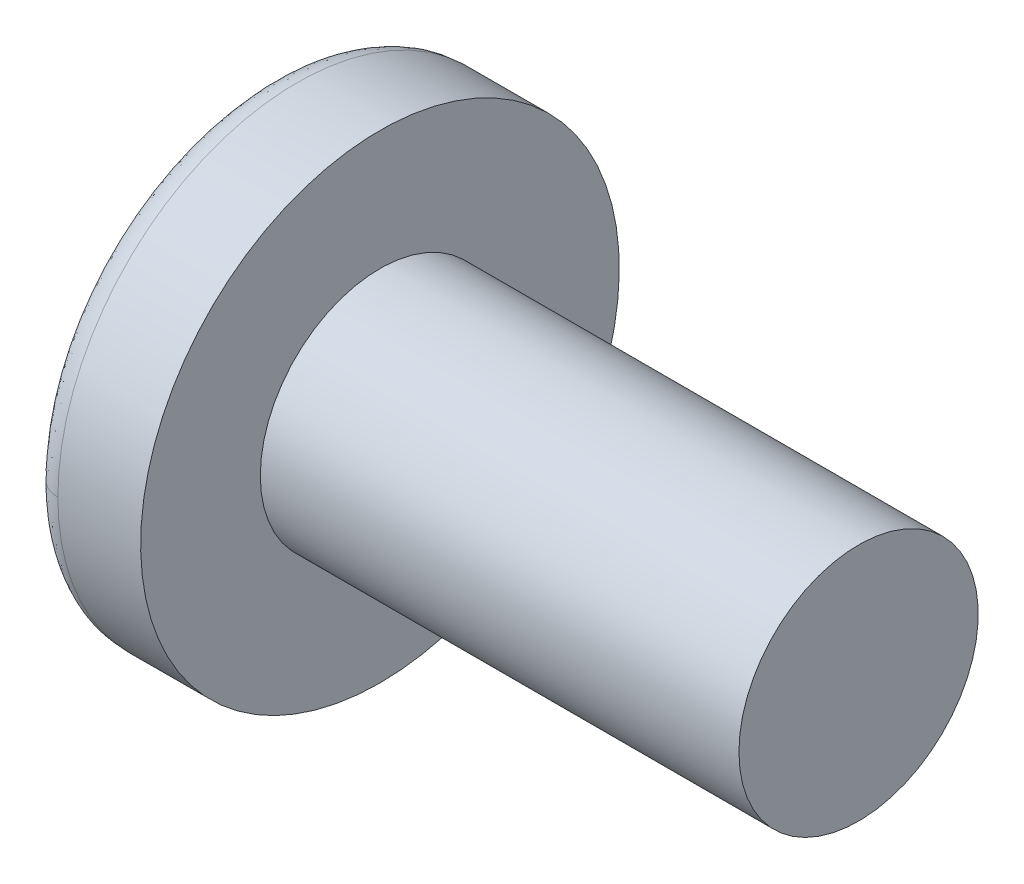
ISO-10303-21;
HEADER;
FILE_DESCRIPTION(('STEP AP214'),'2;1');
FILE_NAME('part.step','',(''),(''),'','','');
FILE_SCHEMA(('AUTOMOTIVE_DESIGN { 1 0 10303 214 1 1 1 1 }'));
ENDSEC;
DATA;
#1=APPLICATION_CONTEXT('core data for automotive mechanical design processes');
#2=APPLICATION_PROTOCOL_DEFINITION('international standard','automotive_design',2000,#1);
#3=PRODUCT_CONTEXT('',#1,'mechanical');
#4=PRODUCT('Part','Part','',(#3));
#5=PRODUCT_RELATED_PRODUCT_CATEGORY('part','',(#4));
#6=PRODUCT_DEFINITION_FORMATION('','',#4);
#7=PRODUCT_DEFINITION_CONTEXT('part definition',#1,'design');
#8=PRODUCT_DEFINITION('design','',#6,#7);
#9=PRODUCT_DEFINITION_SHAPE('','',#8);
#10=(LENGTH_UNIT() NAMED_UNIT(*) SI_UNIT(.MILLI.,.METRE.));
#11=(NAMED_UNIT(*) PLANE_ANGLE_UNIT() SI_UNIT($,.RADIAN.));
#12=(NAMED_UNIT(*) SI_UNIT($,.STERADIAN.) SOLID_ANGLE_UNIT());
#13=UNCERTAINTY_MEASURE_WITH_UNIT(LENGTH_MEASURE(1.E-05),#10,'distance_accuracy_value','');
#14=(GEOMETRIC_REPRESENTATION_CONTEXT(3) GLOBAL_UNCERTAINTY_ASSIGNED_CONTEXT((#13)) GLOBAL_UNIT_ASSIGNED_CONTEXT((#10,
#11,#12)) REPRESENTATION_CONTEXT('',''));
#15=CARTESIAN_POINT('',(0.,0.,0.));
#16=DIRECTION('',(0.,0.,1.));
#17=DIRECTION('',(1.,0.,0.));
#18=AXIS2_PLACEMENT_3D('',#15,#16,#17);
#19=CARTESIAN_POINT('',(22.,-4.048,4.048));
#20=DIRECTION('',(1.,0.,0.));
#21=DIRECTION('',(0.,0.,-1.));
#22=AXIS2_PLACEMENT_3D('',#19,#20,#21);
#23=PLANE('',#22);
#24=CARTESIAN_POINT('',(22.,0.,0.));
#25=DIRECTION('',(-1.,0.,0.));
#26=DIRECTION('',(0.,0.,1.));
#27=AXIS2_PLACEMENT_3D('',#24,#25,#26);
#28=CIRCLE('',#27,4.);
#29=CARTESIAN_POINT('',(22.,0.,4.));
#30=VERTEX_POINT('',#29);
#31=EDGE_CURVE('E21',#30,#30,#28,.T.);
#32=ORIENTED_EDGE('',*,*,#31,.F.);
#33=EDGE_LOOP('',(#32));
#34=FACE_BOUND('',#33,.T.);
#35=ADVANCED_FACE('F17',(#34),#23,.T.);
#36=CARTESIAN_POINT('',(4.88,-0.4225,-0.4225));
#37=DIRECTION('',(-1.,0.,0.));
#38=DIRECTION('',(0.,0.,1.));
#39=AXIS2_PLACEMENT_3D('',#36,#37,#38);
#40=PLANE('',#39);
#41=DIRECTION('',(0.,1.,0.));
#42=VECTOR('',#41,1.);
#43=CARTESIAN_POINT('',(4.88,0.,0.4225));
#44=LINE('',#43,#42);
#45=CARTESIAN_POINT('',(4.87999999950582,-0.422500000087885,0.42250000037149));
#46=VERTEX_POINT('',#45);
#47=CARTESIAN_POINT('',(4.87999999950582,0.422500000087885,0.42250000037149));
#48=VERTEX_POINT('',#47);
#49=EDGE_CURVE('E237',#46,#48,#44,.T.);
#50=ORIENTED_EDGE('',*,*,#49,.T.);
#51=DIRECTION('',(0.,0.,-1.));
#52=VECTOR('',#51,1.);
#53=CARTESIAN_POINT('',(4.88,0.4225,0.));
#54=LINE('',#53,#52);
#55=CARTESIAN_POINT('',(4.87999999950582,0.422500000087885,-0.42250000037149));
#56=VERTEX_POINT('',#55);
#57=EDGE_CURVE('E238',#48,#56,#54,.T.);
#58=ORIENTED_EDGE('',*,*,#57,.T.);
#59=DIRECTION('',(0.,-1.,0.));
#60=VECTOR('',#59,1.);
#61=CARTESIAN_POINT('',(4.88,0.,-0.4225));
#62=LINE('',#61,#60);
#63=CARTESIAN_POINT('',(4.87999999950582,-0.422500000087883,-0.422500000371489));
#64=VERTEX_POINT('',#63);
#65=EDGE_CURVE('E116',#56,#64,#62,.T.);
#66=ORIENTED_EDGE('',*,*,#65,.T.);
#67=DIRECTION('',(0.,0.,1.));
#68=VECTOR('',#67,1.);
#69=CARTESIAN_POINT('',(4.88,-0.4225,0.));
#70=LINE('',#69,#68);
#71=EDGE_CURVE('E264',#64,#46,#70,.T.);
#72=ORIENTED_EDGE('',*,*,#71,.T.);
#73=EDGE_LOOP('',(#50,#58,#66,#72));
#74=FACE_BOUND('',#73,.T.);
#75=ADVANCED_FACE('F368',(#74),#40,.T.);
#76=CARTESIAN_POINT('',(22.,0.,0.));
#77=DIRECTION('',(-1.,0.,0.));
#78=DIRECTION('',(0.,0.,1.));
#79=AXIS2_PLACEMENT_3D('',#76,#77,#78);
#80=CYLINDRICAL_SURFACE('',#79,4.);
#81=CARTESIAN_POINT('',(6.,0.,0.));
#82=DIRECTION('',(-1.,0.,0.));
#83=DIRECTION('',(0.,0.,1.));
#84=AXIS2_PLACEMENT_3D('',#81,#82,#83);
#85=CIRCLE('',#84,4.);
#86=CARTESIAN_POINT('',(6.,0.,4.));
#87=VERTEX_POINT('',#86);
#88=EDGE_CURVE('E265',#87,#87,#85,.F.);
#89=ORIENTED_EDGE('',*,*,#88,.T.);
#90=EDGE_LOOP('',(#89));
#91=FACE_BOUND('',#90,.T.);
#92=ORIENTED_EDGE('',*,*,#31,.T.);
#93=EDGE_LOOP('',(#92));
#94=FACE_BOUND('',#93,.T.);
#95=ADVANCED_FACE('F365',(#91,#94),#80,.T.);
#96=CARTESIAN_POINT('',(0.60051981,0.798550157,-4.007003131));
#97=DIRECTION('',(0.642113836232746,0.,-0.766609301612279));
#98=DIRECTION('',(0.766609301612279,0.,0.642113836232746));
#99=AXIS2_PLACEMENT_3D('',#96,#97,#98);
#100=PLANE('',#99);
#101=ORIENTED_EDGE('',*,*,#65,.F.);
#102=DIRECTION('',(0.764926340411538,-0.0662256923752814,0.640704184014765));
#103=VECTOR('',#102,1.);
#104=CARTESIAN_POINT('',(0.645878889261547,0.789081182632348,-3.96901025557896));
#105=LINE('',#104,#103);
#106=CARTESIAN_POINT('',(0.645878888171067,0.789081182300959,-3.9690102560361));
#107=VERTEX_POINT('',#106);
#108=EDGE_CURVE('E119',#107,#56,#105,.T.);
#109=ORIENTED_EDGE('',*,*,#108,.F.);
#110=CARTESIAN_POINT('',(0.645878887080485,-0.789081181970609,-3.96901025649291));
#111=CARTESIAN_POINT('',(0.632655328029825,-0.526054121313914,-3.9800863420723));
#112=CARTESIAN_POINT('',(0.626043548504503,-0.263027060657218,-3.98562438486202));
#113=CARTESIAN_POINT('',(0.626043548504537,0.263027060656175,-3.98562438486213));
#114=CARTESIAN_POINT('',(0.632655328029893,0.526054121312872,-3.98008634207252));
#115=CARTESIAN_POINT('',(0.645878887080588,0.78908118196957,-3.96901025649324));
#116=B_SPLINE_CURVE_WITH_KNOTS('',3,(#110,#111,#112,#113,#114,#115),.UNSPECIFIED.,.F.,.F.,(4,2,
4),(0.,0.78950527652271,1.57901055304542),.UNSPECIFIED.);
#117=CARTESIAN_POINT('',(0.645878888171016,-0.789081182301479,-3.96901025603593));
#118=VERTEX_POINT('',#117);
#119=EDGE_CURVE('E104',#118,#107,#116,.T.);
#120=ORIENTED_EDGE('',*,*,#119,.F.);
#121=DIRECTION('',(-0.764926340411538,-0.0662256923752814,-0.640704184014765));
#122=VECTOR('',#121,1.);
#123=CARTESIAN_POINT('',(4.87999999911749,-0.422500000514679,-0.422500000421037));
#124=LINE('',#123,#122);
#125=EDGE_CURVE('E124',#64,#118,#124,.T.);
#126=ORIENTED_EDGE('',*,*,#125,.F.);
#127=EDGE_LOOP('',(#101,#109,#120,#126));
#128=FACE_BOUND('',#127,.T.);
#129=ADVANCED_FACE('F120',(#128),#100,.F.);
#130=CARTESIAN_POINT('',(4.88,0.4225,-0.798550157));
#131=DIRECTION('',(0.642113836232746,0.766609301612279,0.));
#132=DIRECTION('',(-0.766609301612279,0.642113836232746,0.));
#133=AXIS2_PLACEMENT_3D('',#130,#131,#132);
#134=PLANE('',#133);
#135=ORIENTED_EDGE('',*,*,#57,.F.);
#136=DIRECTION('',(0.764926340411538,-0.640704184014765,-0.0662256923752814));
#137=VECTOR('',#136,1.);
#138=CARTESIAN_POINT('',(0.645878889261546,3.96901025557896,0.789081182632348));
#139=LINE('',#138,#137);
#140=CARTESIAN_POINT('',(0.645878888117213,3.969010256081,0.789081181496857));
#141=VERTEX_POINT('',#140);
#142=EDGE_CURVE('E280',#141,#48,#139,.T.);
#143=ORIENTED_EDGE('',*,*,#142,.F.);
#144=CARTESIAN_POINT('',(0.626043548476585,3.98562438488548,9.22820369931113E-10));
#145=CARTESIAN_POINT('',(0.626044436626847,3.98562364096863,0.131654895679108));
#146=CARTESIAN_POINT('',(0.627697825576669,3.98423875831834,0.263239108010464));
#147=CARTESIAN_POINT('',(0.634309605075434,3.97870071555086,0.526266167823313));
#148=CARTESIAN_POINT('',(0.639267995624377,3.97454755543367,0.657709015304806));
#149=CARTESIAN_POINT('',(0.64587888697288,3.96901025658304,0.789081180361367));
#150=B_SPLINE_CURVE_WITH_KNOTS('',3,(#144,#145,#146,#147,#148,#149),.UNSPECIFIED.,.F.,.F.,(4,2,
4),(0.,0.394805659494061,0.789611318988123),.UNSPECIFIED.);
#151=CARTESIAN_POINT('',(0.626043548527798,3.98562438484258,2.77471515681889E-09));
#152=VERTEX_POINT('',#151);
#153=EDGE_CURVE('E239',#152,#141,#150,.T.);
#154=ORIENTED_EDGE('',*,*,#153,.F.);
#155=CARTESIAN_POINT('',(0.645878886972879,3.96901025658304,-0.789081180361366));
#156=CARTESIAN_POINT('',(0.63926799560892,3.97454755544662,-0.657709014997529));
#157=CARTESIAN_POINT('',(0.634309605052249,3.97870071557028,-0.526266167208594));
#158=CARTESIAN_POINT('',(0.627697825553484,3.98423875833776,-0.263239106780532));
#159=CARTESIAN_POINT('',(0.62604443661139,3.98562364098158,-0.131654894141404));
#160=CARTESIAN_POINT('',(0.626043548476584,3.98562438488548,9.22820778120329E-10));
#161=B_SPLINE_CURVE_WITH_KNOTS('',3,(#155,#156,#157,#158,#159,#160),.UNSPECIFIED.,.F.,.F.,(4,2,
4),(0.,0.394805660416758,0.789611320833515),.UNSPECIFIED.);
#162=CARTESIAN_POINT('',(0.645878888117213,3.969010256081,-0.789081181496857));
#163=VERTEX_POINT('',#162);
#164=EDGE_CURVE('E353',#163,#152,#161,.T.);
#165=ORIENTED_EDGE('',*,*,#164,.F.);
#166=DIRECTION('',(-0.764926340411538,0.640704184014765,-0.0662256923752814));
#167=VECTOR('',#166,1.);
#168=CARTESIAN_POINT('',(4.87999999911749,0.422500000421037,-0.422500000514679));
#169=LINE('',#168,#167);
#170=EDGE_CURVE('E276',#56,#163,#169,.T.);
#171=ORIENTED_EDGE('',*,*,#170,.F.);
#172=EDGE_LOOP('',(#135,#143,#154,#165,#171));
#173=FACE_BOUND('',#172,.T.);
#174=ADVANCED_FACE('F249',(#173),#134,.F.);
#175=CARTESIAN_POINT('',(4.88,0.798550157,0.4225));
#176=DIRECTION('',(0.642113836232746,0.,0.766609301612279));
#177=DIRECTION('',(-0.766609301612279,0.,0.642113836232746));
#178=AXIS2_PLACEMENT_3D('',#175,#176,#177);
#179=PLANE('',#178);
#180=ORIENTED_EDGE('',*,*,#49,.F.);
#181=DIRECTION('',(0.764926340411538,0.0662256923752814,-0.640704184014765));
#182=VECTOR('',#181,1.);
#183=CARTESIAN_POINT('',(0.645878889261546,-0.789081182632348,3.96901025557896));
#184=LINE('',#183,#182);
#185=CARTESIAN_POINT('',(0.645878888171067,-0.789081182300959,3.9690102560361));
#186=VERTEX_POINT('',#185);
#187=EDGE_CURVE('E289',#186,#46,#184,.T.);
#188=ORIENTED_EDGE('',*,*,#187,.F.);
#189=CARTESIAN_POINT('',(0.645878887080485,0.789081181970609,3.9690102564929));
#190=CARTESIAN_POINT('',(0.632655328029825,0.526054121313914,3.9800863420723));
#191=CARTESIAN_POINT('',(0.626043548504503,0.263027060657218,3.98562438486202));
#192=CARTESIAN_POINT('',(0.626043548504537,-0.263027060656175,3.98562438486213));
#193=CARTESIAN_POINT('',(0.632655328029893,-0.526054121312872,3.98008634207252));
#194=CARTESIAN_POINT('',(0.645878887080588,-0.78908118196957,3.96901025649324));
#195=B_SPLINE_CURVE_WITH_KNOTS('',3,(#189,#190,#191,#192,#193,#194),.UNSPECIFIED.,.F.,.F.,(4,2,
4),(0.,0.78950527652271,1.57901055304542),.UNSPECIFIED.);
#196=CARTESIAN_POINT('',(0.645878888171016,0.789081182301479,3.96901025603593));
#197=VERTEX_POINT('',#196);
#198=EDGE_CURVE('E232',#197,#186,#195,.T.);
#199=ORIENTED_EDGE('',*,*,#198,.F.);
#200=DIRECTION('',(-0.764926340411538,0.0662256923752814,0.640704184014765));
#201=VECTOR('',#200,1.);
#202=CARTESIAN_POINT('',(4.87999999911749,0.422500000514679,0.422500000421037));
#203=LINE('',#202,#201);
#204=EDGE_CURVE('E286',#48,#197,#203,.T.);
#205=ORIENTED_EDGE('',*,*,#204,.F.);
#206=EDGE_LOOP('',(#180,#188,#199,#205));
#207=FACE_BOUND('',#206,.T.);
#208=ADVANCED_FACE('F245',(#207),#179,.F.);
#209=CARTESIAN_POINT('',(0.60051981,-4.007003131,-0.798550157));
#210=DIRECTION('',(0.642113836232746,-0.766609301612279,0.));
#211=DIRECTION('',(0.766609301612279,0.642113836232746,0.));
#212=AXIS2_PLACEMENT_3D('',#209,#210,#211);
#213=PLANE('',#212);
#214=ORIENTED_EDGE('',*,*,#71,.F.);
#215=DIRECTION('',(0.764926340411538,0.640704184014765,0.0662256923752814));
#216=VECTOR('',#215,1.);
#217=CARTESIAN_POINT('',(0.645878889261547,-3.96901025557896,-0.789081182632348));
#218=LINE('',#217,#216);
#219=CARTESIAN_POINT('',(0.645878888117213,-3.969010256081,-0.789081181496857));
#220=VERTEX_POINT('',#219);
#221=EDGE_CURVE('E268',#220,#64,#218,.T.);
#222=ORIENTED_EDGE('',*,*,#221,.F.);
#223=CARTESIAN_POINT('',(0.626043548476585,-3.98562438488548,9.22821577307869E-10));
#224=CARTESIAN_POINT('',(0.62604443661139,-3.98562364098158,-0.131654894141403));
#225=CARTESIAN_POINT('',(0.627697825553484,-3.98423875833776,-0.263239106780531));
#226=CARTESIAN_POINT('',(0.634309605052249,-3.97870071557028,-0.526266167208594));
#227=CARTESIAN_POINT('',(0.63926799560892,-3.97454755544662,-0.657709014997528));
#228=CARTESIAN_POINT('',(0.64587888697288,-3.96901025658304,-0.789081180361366));
#229=B_SPLINE_CURVE_WITH_KNOTS('',3,(#223,#224,#225,#226,#227,#228),.UNSPECIFIED.,.F.,.F.,(4,2,
4),(0.,0.394805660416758,0.789611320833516),.UNSPECIFIED.);
#230=CARTESIAN_POINT('',(0.626043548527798,-3.98562438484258,2.77471621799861E-09));
#231=VERTEX_POINT('',#230);
#232=EDGE_CURVE('E259',#231,#220,#229,.T.);
#233=ORIENTED_EDGE('',*,*,#232,.F.);
#234=CARTESIAN_POINT('',(0.645878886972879,-3.96901025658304,0.789081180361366));
#235=CARTESIAN_POINT('',(0.639267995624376,-3.97454755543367,0.657709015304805));
#236=CARTESIAN_POINT('',(0.634309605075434,-3.97870071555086,0.526266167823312));
#237=CARTESIAN_POINT('',(0.627697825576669,-3.98423875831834,0.263239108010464));
#238=CARTESIAN_POINT('',(0.626044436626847,-3.98562364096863,0.131654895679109));
#239=CARTESIAN_POINT('',(0.626043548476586,-3.98562438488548,9.22821274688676E-10));
#240=B_SPLINE_CURVE_WITH_KNOTS('',3,(#234,#235,#236,#237,#238,#239),.UNSPECIFIED.,.F.,.F.,(4,2,
4),(0.,0.39480565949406,0.789611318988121),.UNSPECIFIED.);
#241=CARTESIAN_POINT('',(0.645878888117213,-3.969010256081,0.789081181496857));
#242=VERTEX_POINT('',#241);
#243=EDGE_CURVE('E225',#242,#231,#240,.T.);
#244=ORIENTED_EDGE('',*,*,#243,.F.);
#245=DIRECTION('',(-0.764926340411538,-0.640704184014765,0.0662256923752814));
#246=VECTOR('',#245,1.);
#247=CARTESIAN_POINT('',(4.87999999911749,-0.422500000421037,0.422500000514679));
#248=LINE('',#247,#246);
#249=EDGE_CURVE('E295',#46,#242,#248,.T.);
#250=ORIENTED_EDGE('',*,*,#249,.F.);
#251=EDGE_LOOP('',(#214,#222,#233,#244,#250));
#252=FACE_BOUND('',#251,.T.);
#253=ADVANCED_FACE('F248',(#252),#213,.F.);
#254=CARTESIAN_POINT('',(6.,-8.096,-8.096));
#255=DIRECTION('',(-1.,0.,0.));
#256=DIRECTION('',(0.,0.,1.));
#257=AXIS2_PLACEMENT_3D('',#254,#255,#256);
#258=PLANE('',#257);
#259=ORIENTED_EDGE('',*,*,#88,.F.);
#260=EDGE_LOOP('',(#259));
#261=FACE_BOUND('',#260,.T.);
#262=CARTESIAN_POINT('',(6.,0.,0.));
#263=DIRECTION('',(-1.,0.,0.));
#264=DIRECTION('',(0.,-1.,0.));
#265=AXIS2_PLACEMENT_3D('',#262,#263,#264);
#266=CIRCLE('',#265,8.);
#267=CARTESIAN_POINT('',(6.,-8.,0.));
#268=VERTEX_POINT('',#267);
#269=EDGE_CURVE('E298',#268,#268,#266,.T.);
#270=ORIENTED_EDGE('',*,*,#269,.F.);
#271=EDGE_LOOP('',(#270));
#272=FACE_BOUND('',#271,.T.);
#273=ADVANCED_FACE('F256',(#261,#272),#258,.F.);
#274=CARTESIAN_POINT('',(0.025474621,-3.990289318,-0.842794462));
#275=DIRECTION('',(-0.0862551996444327,0.,0.996273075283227));
#276=DIRECTION('',(0.996273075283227,0.,0.0862551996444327));
#277=AXIS2_PLACEMENT_3D('',#274,#275,#276);
#278=PLANE('',#277);
#279=DIRECTION('',(0.992587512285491,0.0859361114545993,0.0859361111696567));
#280=VECTOR('',#279,1.);
#281=CARTESIAN_POINT('',(0.0544280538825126,-0.840287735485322,-0.8402877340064));
#282=LINE('',#281,#280);
#283=CARTESIAN_POINT('',(0.0544280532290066,-0.840287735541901,-0.840287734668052));
#284=VERTEX_POINT('',#283);
#285=EDGE_CURVE('E271',#284,#64,#282,.T.);
#286=ORIENTED_EDGE('',*,*,#285,.F.);
#287=CARTESIAN_POINT('',(0.645878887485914,-3.96901025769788,-0.789081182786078));
#288=CARTESIAN_POINT('',(0.613384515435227,-3.86730842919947,-0.791894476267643));
#289=CARTESIAN_POINT('',(0.582139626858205,-3.76520441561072,-0.794599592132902));
#290=CARTESIAN_POINT('',(0.522238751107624,-3.56050099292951,-0.799785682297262));
#291=CARTESIAN_POINT('',(0.493576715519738,-3.45790336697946,-0.802267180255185));
#292=CARTESIAN_POINT('',(0.438824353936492,-3.25221726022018,-0.807007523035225));
#293=CARTESIAN_POINT('',(0.412729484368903,-3.14912999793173,-0.809266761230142));
#294=CARTESIAN_POINT('',(0.363098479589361,-2.94246801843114,-0.813563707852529));
#295=CARTESIAN_POINT('',(0.339559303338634,-2.83889403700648,-0.815601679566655));
#296=CARTESIAN_POINT('',(0.295031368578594,-2.63126074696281,-0.819456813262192));
#297=CARTESIAN_POINT('',(0.274041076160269,-2.52720176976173,-0.821274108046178));
#298=CARTESIAN_POINT('',(0.234606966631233,-2.31859882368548,-0.824688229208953));
#299=CARTESIAN_POINT('',(0.216163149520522,-2.2140548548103,-0.826285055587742));
#300=CARTESIAN_POINT('',(0.181822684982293,-2.00448129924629,-0.829258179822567));
#301=CARTESIAN_POINT('',(0.165927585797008,-1.89945145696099,-0.830634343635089));
#302=CARTESIAN_POINT('',(0.136689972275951,-1.68890543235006,-0.833165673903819));
#303=CARTESIAN_POINT('',(0.123350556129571,-1.58338881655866,-0.834320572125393));
#304=CARTESIAN_POINT('',(0.0992344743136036,-1.37186784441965,-0.836408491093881));
#305=CARTESIAN_POINT('',(0.0884624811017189,-1.265862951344,-0.837341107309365));
#306=CARTESIAN_POINT('',(0.0694956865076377,-1.05336338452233,-0.838983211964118));
#307=CARTESIAN_POINT('',(0.0613071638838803,-0.946868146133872,-0.839692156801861));
#308=CARTESIAN_POINT('',(0.0544280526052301,-0.840287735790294,-0.840287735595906));
#309=B_SPLINE_CURVE_WITH_KNOTS('',3,(#287,#288,#289,#290,#291,#292,#293,#294,#295,#296,#297,
#298,#299,#300,#301,#302,#303,#304,#305,#306,#307,#308),.UNSPECIFIED.,.F.,.F.,(4,2,2,2,2,2,2,2,
2,2,4),(0.,0.320403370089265,0.640035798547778,0.959091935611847,1.27776416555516,
1.59624365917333,1.91472315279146,2.23339538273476,2.55245151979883,2.87208394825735,
3.1924873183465),.UNSPECIFIED.);
#310=EDGE_CURVE('E133',#220,#284,#309,.T.);
#311=ORIENTED_EDGE('',*,*,#310,.F.);
#312=ORIENTED_EDGE('',*,*,#221,.T.);
#313=EDGE_LOOP('',(#286,#311,#312));
#314=FACE_BOUND('',#313,.T.);
#315=ADVANCED_FACE('F304',(#314),#278,.T.);
#316=CARTESIAN_POINT('',(4.908953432,-0.419993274,-3.990289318));
#317=DIRECTION('',(-0.0862551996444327,0.996273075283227,0.));
#318=DIRECTION('',(-0.996273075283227,-0.0862551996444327,0.));
#319=AXIS2_PLACEMENT_3D('',#316,#317,#318);
#320=PLANE('',#319);
#321=ORIENTED_EDGE('',*,*,#285,.T.);
#322=ORIENTED_EDGE('',*,*,#125,.T.);
#323=CARTESIAN_POINT('',(0.0544280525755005,-0.840287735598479,-0.840287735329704));
#324=CARTESIAN_POINT('',(0.061307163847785,-0.839692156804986,-0.946868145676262));
#325=CARTESIAN_POINT('',(0.0694956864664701,-0.838983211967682,-1.05336338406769));
#326=CARTESIAN_POINT('',(0.0884624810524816,-0.837341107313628,-1.26586295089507));
#327=CARTESIAN_POINT('',(0.0992344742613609,-0.836408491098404,-1.37186784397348));
#328=CARTESIAN_POINT('',(0.123350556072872,-0.834320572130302,-1.58338881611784));
#329=CARTESIAN_POINT('',(0.136689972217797,-0.833165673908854,-1.68890543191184));
#330=CARTESIAN_POINT('',(0.16592758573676,-0.830634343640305,-1.89945145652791));
#331=CARTESIAN_POINT('',(0.181822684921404,-0.829258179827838,-2.00448129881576));
#332=CARTESIAN_POINT('',(0.21616314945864,-0.8262850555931,-2.21405485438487));
#333=CARTESIAN_POINT('',(0.234606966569,-0.824688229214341,-2.3185988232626));
#334=CARTESIAN_POINT('',(0.274041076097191,-0.821274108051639,-2.52720176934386));
#335=CARTESIAN_POINT('',(0.295031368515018,-0.819456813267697,-2.63126074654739));
#336=CARTESIAN_POINT('',(0.33955930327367,-0.815601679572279,-2.83889403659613));
#337=CARTESIAN_POINT('',(0.363098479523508,-0.813563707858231,-2.94246801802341));
#338=CARTESIAN_POINT('',(0.412729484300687,-0.809266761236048,-3.14912999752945));
#339=CARTESIAN_POINT('',(0.438824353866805,-0.807007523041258,-3.25221725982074));
#340=CARTESIAN_POINT('',(0.493576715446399,-0.802267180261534,-3.45790336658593));
#341=CARTESIAN_POINT('',(0.522238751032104,-0.7997856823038,-3.56050099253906));
#342=CARTESIAN_POINT('',(0.582139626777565,-0.794599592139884,-3.76520441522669));
#343=CARTESIAN_POINT('',(0.613384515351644,-0.791894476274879,-3.86730842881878));
#344=CARTESIAN_POINT('',(0.645878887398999,-0.789081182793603,-3.96901025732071));
#345=B_SPLINE_CURVE_WITH_KNOTS('',3,(#323,#324,#325,#326,#327,#328,#329,#330,#331,#332,#333,
#334,#335,#336,#337,#338,#339,#340,#341,#342,#343,#344),.UNSPECIFIED.,.F.,.F.,(4,2,2,2,2,2,2,2,
2,2,4),(0.,0.320403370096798,0.640035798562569,0.9590919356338,1.27776416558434,
1.59624365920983,1.91472315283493,2.23339538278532,2.55245151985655,2.87208394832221,
3.19248731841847),.UNSPECIFIED.);
#346=EDGE_CURVE('E115',#284,#118,#345,.T.);
#347=ORIENTED_EDGE('',*,*,#346,.F.);
#348=EDGE_LOOP('',(#321,#322,#347));
#349=FACE_BOUND('',#348,.T.);
#350=ADVANCED_FACE('F158',(#349),#320,.T.);
#351=CARTESIAN_POINT('',(0.025474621,0.842794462,-3.990289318));
#352=DIRECTION('',(-0.0862551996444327,-0.996273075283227,0.));
#353=DIRECTION('',(0.996273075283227,-0.0862551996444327,0.));
#354=AXIS2_PLACEMENT_3D('',#351,#352,#353);
#355=PLANE('',#354);
#356=ORIENTED_EDGE('',*,*,#108,.T.);
#357=DIRECTION('',(0.992587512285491,-0.0859361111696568,0.0859361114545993));
#358=VECTOR('',#357,1.);
#359=CARTESIAN_POINT('',(0.0544280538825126,0.8402877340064,-0.840287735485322));
#360=LINE('',#359,#358);
#361=CARTESIAN_POINT('',(0.0544280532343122,0.84028773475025,-0.840287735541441));
#362=VERTEX_POINT('',#361);
#363=EDGE_CURVE('E123',#362,#56,#360,.T.);
#364=ORIENTED_EDGE('',*,*,#363,.F.);
#365=CARTESIAN_POINT('',(0.645878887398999,0.789081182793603,-3.96901025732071));
#366=CARTESIAN_POINT('',(0.613384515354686,0.791894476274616,-3.86730842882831));
#367=CARTESIAN_POINT('',(0.582139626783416,0.794599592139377,-3.76520441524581));
#368=CARTESIAN_POINT('',(0.52223875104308,0.79978568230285,-3.56050099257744));
#369=CARTESIAN_POINT('',(0.493576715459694,0.802267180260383,-3.45790336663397));
#370=CARTESIAN_POINT('',(0.43882435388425,0.807007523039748,-3.25221725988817));
#371=CARTESIAN_POINT('',(0.412729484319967,0.809266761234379,-3.14912999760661));
#372=CARTESIAN_POINT('',(0.363098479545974,0.813563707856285,-2.94246801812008));
#373=CARTESIAN_POINT('',(0.33955930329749,0.815601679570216,-2.83889403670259));
#374=CARTESIAN_POINT('',(0.295031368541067,0.819456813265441,-2.63126074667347));
#375=CARTESIAN_POINT('',(0.274041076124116,0.821274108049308,-2.52720176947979));
#376=CARTESIAN_POINT('',(0.234606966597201,0.8246882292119,-2.31859882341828));
#377=CARTESIAN_POINT('',(0.21616314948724,0.826285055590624,-2.21405485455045));
#378=CARTESIAN_POINT('',(0.181822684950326,0.829258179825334,-2.00448129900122));
#379=CARTESIAN_POINT('',(0.165927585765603,0.830634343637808,-1.89945145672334));
#380=CARTESIAN_POINT('',(0.136689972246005,0.833165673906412,-1.68890543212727));
#381=CARTESIAN_POINT('',(0.123350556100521,0.834320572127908,-1.58338881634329));
#382=CARTESIAN_POINT('',(0.0992344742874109,0.836408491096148,-1.37186784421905));
#383=CARTESIAN_POINT('',(0.0884624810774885,0.837341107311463,-1.26586295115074));
#384=CARTESIAN_POINT('',(0.0694956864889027,0.83898321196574,-1.05336338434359));
#385=CARTESIAN_POINT('',(0.061307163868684,0.839692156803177,-0.946868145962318));
#386=CARTESIAN_POINT('',(0.0544280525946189,0.840287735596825,-0.840287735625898));
#387=B_SPLINE_CURVE_WITH_KNOTS('',3,(#365,#366,#367,#368,#369,#370,#371,#372,#373,#374,#375,
#376,#377,#378,#379,#380,#381,#382,#383,#384,#385,#386),.UNSPECIFIED.,.F.,.F.,(4,2,2,2,2,2,2,2,
2,2,4),(0.,0.320403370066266,0.640035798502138,0.959091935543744,1.27776416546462,
1.59624365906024,1.91472315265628,2.23339538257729,2.5524515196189,2.87208394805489,
3.19248731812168),.UNSPECIFIED.);
#388=EDGE_CURVE('E112',#107,#362,#387,.T.);
#389=ORIENTED_EDGE('',*,*,#388,.F.);
#390=EDGE_LOOP('',(#356,#364,#389));
#391=FACE_BOUND('',#390,.T.);
#392=ADVANCED_FACE('F126',(#391),#355,.T.);
#393=CARTESIAN_POINT('',(0.025474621,0.401220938,-0.842794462));
#394=DIRECTION('',(-0.0862551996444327,0.,0.996273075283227));
#395=DIRECTION('',(0.996273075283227,0.,0.0862551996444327));
#396=AXIS2_PLACEMENT_3D('',#393,#394,#395);
#397=PLANE('',#396);
#398=ORIENTED_EDGE('',*,*,#363,.T.);
#399=ORIENTED_EDGE('',*,*,#170,.T.);
#400=CARTESIAN_POINT('',(0.0544280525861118,0.840287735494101,-0.840287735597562));
#401=CARTESIAN_POINT('',(0.0613071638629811,0.946868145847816,-0.839692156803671));
#402=CARTESIAN_POINT('',(0.069495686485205,1.05336338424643,-0.83898321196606));
#403=CARTESIAN_POINT('',(0.088462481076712,1.26586295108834,-0.83734110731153));
#404=CARTESIAN_POINT('',(0.0992344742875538,1.37186784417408,-0.836408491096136));
#405=CARTESIAN_POINT('',(0.123350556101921,1.5833888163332,-0.834320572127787));
#406=CARTESIAN_POINT('',(0.136689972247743,1.68890543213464,-0.833165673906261));
#407=CARTESIAN_POINT('',(0.165927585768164,1.89945145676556,-0.830634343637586));
#408=CARTESIAN_POINT('',(0.181822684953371,2.00448129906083,-0.829258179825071));
#409=CARTESIAN_POINT('',(0.216163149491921,2.21405485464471,-0.826285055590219));
#410=CARTESIAN_POINT('',(0.234606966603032,2.3185988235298,-0.824688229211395));
#411=CARTESIAN_POINT('',(0.274041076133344,2.5272017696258,-0.821274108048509));
#412=CARTESIAN_POINT('',(0.295031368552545,2.63126074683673,-0.819456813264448));
#413=CARTESIAN_POINT('',(0.339559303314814,2.83889403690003,-0.815601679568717));
#414=CARTESIAN_POINT('',(0.363098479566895,2.94246801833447,-0.813563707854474));
#415=CARTESIAN_POINT('',(0.412729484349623,3.14912999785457,-0.809266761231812));
#416=CARTESIAN_POINT('',(0.438824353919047,3.25221726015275,-0.807007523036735));
#417=CARTESIAN_POINT('',(0.493576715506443,3.45790336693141,-0.802267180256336));
#418=CARTESIAN_POINT('',(0.522238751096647,3.56050099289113,-0.799785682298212));
#419=CARTESIAN_POINT('',(0.582139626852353,3.7652044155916,-0.794599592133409));
#420=CARTESIAN_POINT('',(0.613384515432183,3.86730842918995,-0.791894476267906));
#421=CARTESIAN_POINT('',(0.645878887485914,3.96901025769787,-0.789081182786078));
#422=B_SPLINE_CURVE_WITH_KNOTS('',3,(#400,#401,#402,#403,#404,#405,#406,#407,#408,#409,#410,
#411,#412,#413,#414,#415,#416,#417,#418,#419,#420,#421),.UNSPECIFIED.,.F.,.F.,(4,2,2,2,2,2,2,2,
2,2,4),(0.,0.320403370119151,0.640035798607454,0.95909193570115,1.27776416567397,
1.59624365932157,1.9147231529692,2.23339538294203,2.55245152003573,2.87208394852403,
3.19248731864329),.UNSPECIFIED.);
#423=EDGE_CURVE('E129',#362,#163,#422,.T.);
#424=ORIENTED_EDGE('',*,*,#423,.F.);
#425=EDGE_LOOP('',(#398,#399,#424));
#426=FACE_BOUND('',#425,.T.);
#427=ADVANCED_FACE('F157',(#426),#397,.T.);
#428=CARTESIAN_POINT('',(2.401771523,0.,-7.520775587));
#429=CARTESIAN_POINT('',(2.401771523,-15.041551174,-7.520775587));
#430=CARTESIAN_POINT('',(2.401771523,-15.041551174,7.520775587));
#431=CARTESIAN_POINT('',(2.401771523,0.,7.520775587));
#432=CARTESIAN_POINT('',(2.596300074,0.,-7.856984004));
#433=CARTESIAN_POINT('',(2.596300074,-15.713968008,-7.856984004));
#434=CARTESIAN_POINT('',(2.596300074,-15.713968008,7.856984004));
#435=CARTESIAN_POINT('',(2.596300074,0.,7.856984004));
#436=CARTESIAN_POINT('',(2.942058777,0.,-8.03398224));
#437=CARTESIAN_POINT('',(2.942058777,-16.06796448,-8.03398224));
#438=CARTESIAN_POINT('',(2.942058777,-16.06796448,8.03398224));
#439=CARTESIAN_POINT('',(2.942058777,0.,8.03398224));
#440=CARTESIAN_POINT('',(3.328547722,0.,-7.995203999));
#441=CARTESIAN_POINT('',(3.328547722,-15.990407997,-7.995203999));
#442=CARTESIAN_POINT('',(3.328547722,-15.990407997,7.995203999));
#443=CARTESIAN_POINT('',(3.328547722,0.,7.995203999));
#444=(BOUNDED_SURFACE() B_SPLINE_SURFACE(3,3,((#428,#429,#430,#431),(#432,#433,#434,#435),(#436,
#437,#438,#439),(#440,#441,#442,#443)),.UNSPECIFIED.,.F.,.F.,
.F.) B_SPLINE_SURFACE_WITH_KNOTS((4,4),(4,4),(0.,1.),(0.,1.),
.UNSPECIFIED.) GEOMETRIC_REPRESENTATION_ITEM() RATIONAL_B_SPLINE_SURFACE(((1.,0.333333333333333,
0.333333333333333,1.),(0.893471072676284,0.297823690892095,0.297823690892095,0.893471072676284),
(0.893471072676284,0.297823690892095,0.297823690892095,0.893471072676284),(1.,0.333333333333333,
0.333333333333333,1.))) REPRESENTATION_ITEM('') SURFACE());
#445=CARTESIAN_POINT('',(2.453920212,-7.563353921,-0.758866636));
#446=CARTESIAN_POINT('',(2.453920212,-8.043972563,4.03128847));
#447=CARTESIAN_POINT('',(2.453920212,-4.814206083,7.601328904));
#448=CARTESIAN_POINT('',(2.453920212,0.,7.601328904));
#449=CARTESIAN_POINT('',(2.453920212,4.814206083,7.601328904));
#450=CARTESIAN_POINT('',(2.453920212,8.043972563,4.03128847));
#451=CARTESIAN_POINT('',(2.453920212,7.563353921,-0.758866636));
#452=(BOUNDED_CURVE() B_SPLINE_CURVE(3,(#445,#446,#447,#448,#449,#450,#451),.UNSPECIFIED.,.F.,
.F.) B_SPLINE_CURVE_WITH_KNOTS((4,3,4),(0.,0.5,1.),
.UNSPECIFIED.) CURVE() GEOMETRIC_REPRESENTATION_ITEM() RATIONAL_B_SPLINE_CURVE((1.,
0.780588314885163,0.780588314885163,1.,0.780588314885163,0.780588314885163,1.)) REPRESENTATION_ITEM(''));
#453=CARTESIAN_POINT('',(2.45392021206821,-7.60132890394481,1.66384160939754E-09));
#454=VERTEX_POINT('',#453);
#455=CARTESIAN_POINT('',(2.45392021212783,-1.22347464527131E-13,7.60132890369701));
#456=VERTEX_POINT('',#455);
#457=EDGE_CURVE('E328',#454,#456,#452,.T.);
#458=CARTESIAN_POINT('',(2.453920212,7.563353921,0.758866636));
#459=CARTESIAN_POINT('',(2.453920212,8.043972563,-4.03128847));
#460=CARTESIAN_POINT('',(2.453920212,4.814206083,-7.601328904));
#461=CARTESIAN_POINT('',(2.453920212,0.,-7.601328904));
#462=CARTESIAN_POINT('',(2.453920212,-4.814206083,-7.601328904));
#463=CARTESIAN_POINT('',(2.453920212,-8.043972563,-4.03128847));
#464=CARTESIAN_POINT('',(2.453920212,-7.563353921,0.758866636));
#465=(BOUNDED_CURVE() B_SPLINE_CURVE(3,(#458,#459,#460,#461,#462,#463,#464),.UNSPECIFIED.,.F.,
.F.) B_SPLINE_CURVE_WITH_KNOTS((4,3,4),(0.,0.5,1.),
.UNSPECIFIED.) CURVE() GEOMETRIC_REPRESENTATION_ITEM() RATIONAL_B_SPLINE_CURVE((1.,
0.780588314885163,0.780588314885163,1.,0.780588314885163,0.780588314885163,1.)) REPRESENTATION_ITEM(''));
#466=CARTESIAN_POINT('',(2.4539202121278,1.22347464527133E-13,-7.60132890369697));
#467=VERTEX_POINT('',#466);
#468=EDGE_CURVE('E300',#467,#454,#465,.T.);
#469=CARTESIAN_POINT('',(2.401771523,0.,-7.520775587));
#470=CARTESIAN_POINT('',(2.596300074,0.,-7.856984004));
#471=CARTESIAN_POINT('',(2.942058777,0.,-8.03398224));
#472=CARTESIAN_POINT('',(3.328547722,0.,-7.995203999));
#473=(BOUNDED_CURVE() B_SPLINE_CURVE(3,(#469,#470,#471,#472),.UNSPECIFIED.,.F.,
.F.) B_SPLINE_CURVE_WITH_KNOTS((4,4),(0.,1.),
.UNSPECIFIED.) CURVE() GEOMETRIC_REPRESENTATION_ITEM() RATIONAL_B_SPLINE_CURVE((1.,
0.893471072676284,0.893471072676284,1.)) REPRESENTATION_ITEM(''));
#474=CARTESIAN_POINT('',(3.23270764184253,0.,-8.00000000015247));
#475=VERTEX_POINT('',#474);
#476=EDGE_CURVE('E279',#467,#475,#473,.T.);
#477=CARTESIAN_POINT('',(3.23270764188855,0.,0.));
#478=DIRECTION('',(-1.,0.,0.));
#479=DIRECTION('',(0.,-1.,0.));
#480=AXIS2_PLACEMENT_3D('',#477,#478,#479);
#481=CIRCLE('',#480,8.0000000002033);
#482=CARTESIAN_POINT('',(3.23270764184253,0.,8.00000000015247));
#483=VERTEX_POINT('',#482);
#484=EDGE_CURVE('E350',#475,#483,#481,.T.);
#485=CARTESIAN_POINT('',(2.401771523,0.,7.520775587));
#486=CARTESIAN_POINT('',(2.596300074,0.,7.856984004));
#487=CARTESIAN_POINT('',(2.942058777,0.,8.03398224));
#488=CARTESIAN_POINT('',(3.328547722,0.,7.995203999));
#489=(BOUNDED_CURVE() B_SPLINE_CURVE(3,(#485,#486,#487,#488),.UNSPECIFIED.,.F.,
.F.) B_SPLINE_CURVE_WITH_KNOTS((4,4),(0.,1.),
.UNSPECIFIED.) CURVE() GEOMETRIC_REPRESENTATION_ITEM() RATIONAL_B_SPLINE_CURVE((1.,
0.893471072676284,0.893471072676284,1.)) REPRESENTATION_ITEM(''));
#490=EDGE_CURVE('E36',#483,#456,#489,.F.);
#491=ORIENTED_EDGE('',*,*,#457,.F.);
#492=ORIENTED_EDGE('',*,*,#468,.F.);
#493=ORIENTED_EDGE('',*,*,#476,.T.);
#494=ORIENTED_EDGE('',*,*,#484,.T.);
#495=ORIENTED_EDGE('',*,*,#490,.T.);
#496=EDGE_LOOP('',(#491,#492,#493,#494,#495));
#497=FACE_BOUND('',#496,.T.);
#498=ADVANCED_FACE('F164',(#497),#444,.T.);
#499=CARTESIAN_POINT('',(4.908953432,0.401220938,0.419993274));
#500=DIRECTION('',(-0.0862551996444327,0.,-0.996273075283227));
#501=DIRECTION('',(-0.996273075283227,0.,0.0862551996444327));
#502=AXIS2_PLACEMENT_3D('',#499,#500,#501);
#503=PLANE('',#502);
#504=DIRECTION('',(0.992587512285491,-0.0859361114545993,-0.0859361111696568));
#505=VECTOR('',#504,1.);
#506=CARTESIAN_POINT('',(0.0544280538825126,0.840287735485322,0.8402877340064));
#507=LINE('',#506,#505);
#508=CARTESIAN_POINT('',(0.0544280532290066,0.840287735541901,0.840287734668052));
#509=VERTEX_POINT('',#508);
#510=EDGE_CURVE('E283',#509,#48,#507,.T.);
#511=ORIENTED_EDGE('',*,*,#510,.F.);
#512=CARTESIAN_POINT('',(0.645878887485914,3.96901025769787,0.78908118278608));
#513=CARTESIAN_POINT('',(0.613384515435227,3.86730842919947,0.791894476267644));
#514=CARTESIAN_POINT('',(0.582139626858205,3.76520441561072,0.794599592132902));
#515=CARTESIAN_POINT('',(0.522238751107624,3.56050099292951,0.799785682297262));
#516=CARTESIAN_POINT('',(0.493576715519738,3.45790336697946,0.802267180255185));
#517=CARTESIAN_POINT('',(0.438824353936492,3.25221726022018,0.807007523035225));
#518=CARTESIAN_POINT('',(0.412729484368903,3.14912999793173,0.809266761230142));
#519=CARTESIAN_POINT('',(0.363098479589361,2.94246801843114,0.813563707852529));
#520=CARTESIAN_POINT('',(0.339559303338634,2.83889403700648,0.815601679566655));
#521=CARTESIAN_POINT('',(0.295031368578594,2.63126074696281,0.819456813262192));
#522=CARTESIAN_POINT('',(0.274041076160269,2.52720176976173,0.821274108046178));
#523=CARTESIAN_POINT('',(0.234606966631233,2.31859882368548,0.824688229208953));
#524=CARTESIAN_POINT('',(0.216163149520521,2.2140548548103,0.826285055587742));
#525=CARTESIAN_POINT('',(0.181822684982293,2.00448129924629,0.829258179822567));
#526=CARTESIAN_POINT('',(0.165927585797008,1.89945145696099,0.830634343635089));
#527=CARTESIAN_POINT('',(0.136689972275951,1.68890543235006,0.833165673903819));
#528=CARTESIAN_POINT('',(0.123350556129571,1.58338881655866,0.834320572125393));
#529=CARTESIAN_POINT('',(0.0992344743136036,1.37186784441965,0.836408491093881));
#530=CARTESIAN_POINT('',(0.0884624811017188,1.265862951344,0.837341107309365));
#531=CARTESIAN_POINT('',(0.0694956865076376,1.05336338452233,0.838983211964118));
#532=CARTESIAN_POINT('',(0.0613071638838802,0.946868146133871,0.839692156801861));
#533=CARTESIAN_POINT('',(0.05442805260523,0.840287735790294,0.840287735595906));
#534=B_SPLINE_CURVE_WITH_KNOTS('',3,(#512,#513,#514,#515,#516,#517,#518,#519,#520,#521,#522,
#523,#524,#525,#526,#527,#528,#529,#530,#531,#532,#533),.UNSPECIFIED.,.F.,.F.,(4,2,2,2,2,2,2,2,
2,2,4),(0.,0.320403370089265,0.640035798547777,0.959091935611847,1.27776416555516,
1.59624365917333,1.91472315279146,2.23339538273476,2.55245151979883,2.87208394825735,
3.1924873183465),.UNSPECIFIED.);
#535=EDGE_CURVE('E174',#141,#509,#534,.T.);
#536=ORIENTED_EDGE('',*,*,#535,.F.);
#537=ORIENTED_EDGE('',*,*,#142,.T.);
#538=EDGE_LOOP('',(#511,#536,#537));
#539=FACE_BOUND('',#538,.T.);
#540=ADVANCED_FACE('F166',(#539),#503,.T.);
#541=CARTESIAN_POINT('',(0.025474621,0.842794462,0.401220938));
#542=DIRECTION('',(-0.0862551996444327,-0.996273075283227,0.));
#543=DIRECTION('',(0.996273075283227,-0.0862551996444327,0.));
#544=AXIS2_PLACEMENT_3D('',#541,#542,#543);
#545=PLANE('',#544);
#546=ORIENTED_EDGE('',*,*,#510,.T.);
#547=ORIENTED_EDGE('',*,*,#204,.T.);
#548=CARTESIAN_POINT('',(0.0544280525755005,0.84028773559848,0.840287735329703));
#549=CARTESIAN_POINT('',(0.0613071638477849,0.839692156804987,0.946868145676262));
#550=CARTESIAN_POINT('',(0.06949568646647,0.838983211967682,1.05336338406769));
#551=CARTESIAN_POINT('',(0.0884624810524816,0.837341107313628,1.26586295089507));
#552=CARTESIAN_POINT('',(0.0992344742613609,0.836408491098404,1.37186784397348));
#553=CARTESIAN_POINT('',(0.123350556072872,0.834320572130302,1.58338881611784));
#554=CARTESIAN_POINT('',(0.136689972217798,0.833165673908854,1.68890543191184));
#555=CARTESIAN_POINT('',(0.16592758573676,0.830634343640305,1.89945145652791));
#556=CARTESIAN_POINT('',(0.181822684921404,0.829258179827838,2.00448129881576));
#557=CARTESIAN_POINT('',(0.21616314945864,0.8262850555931,2.21405485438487));
#558=CARTESIAN_POINT('',(0.234606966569,0.824688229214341,2.3185988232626));
#559=CARTESIAN_POINT('',(0.274041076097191,0.821274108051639,2.52720176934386));
#560=CARTESIAN_POINT('',(0.295031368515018,0.819456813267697,2.63126074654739));
#561=CARTESIAN_POINT('',(0.33955930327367,0.815601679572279,2.83889403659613));
#562=CARTESIAN_POINT('',(0.363098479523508,0.813563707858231,2.94246801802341));
#563=CARTESIAN_POINT('',(0.412729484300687,0.809266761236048,3.14912999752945));
#564=CARTESIAN_POINT('',(0.438824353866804,0.807007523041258,3.25221725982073));
#565=CARTESIAN_POINT('',(0.493576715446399,0.802267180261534,3.45790336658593));
#566=CARTESIAN_POINT('',(0.522238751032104,0.7997856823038,3.56050099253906));
#567=CARTESIAN_POINT('',(0.582139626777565,0.794599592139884,3.76520441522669));
#568=CARTESIAN_POINT('',(0.613384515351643,0.79189447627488,3.86730842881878));
#569=CARTESIAN_POINT('',(0.645878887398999,0.789081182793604,3.96901025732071));
#570=B_SPLINE_CURVE_WITH_KNOTS('',3,(#548,#549,#550,#551,#552,#553,#554,#555,#556,#557,#558,
#559,#560,#561,#562,#563,#564,#565,#566,#567,#568,#569),.UNSPECIFIED.,.F.,.F.,(4,2,2,2,2,2,2,2,
2,2,4),(0.,0.320403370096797,0.640035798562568,0.9590919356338,1.27776416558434,
1.59624365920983,1.91472315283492,2.23339538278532,2.55245151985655,2.87208394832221,
3.19248731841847),.UNSPECIFIED.);
#571=EDGE_CURVE('E180',#509,#197,#570,.T.);
#572=ORIENTED_EDGE('',*,*,#571,.F.);
#573=EDGE_LOOP('',(#546,#547,#572));
#574=FACE_BOUND('',#573,.T.);
#575=ADVANCED_FACE('F170',(#574),#545,.T.);
#576=CARTESIAN_POINT('',(4.908953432,-0.419993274,0.401220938));
#577=DIRECTION('',(-0.0862551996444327,0.996273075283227,0.));
#578=DIRECTION('',(-0.996273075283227,-0.0862551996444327,0.));
#579=AXIS2_PLACEMENT_3D('',#576,#577,#578);
#580=PLANE('',#579);
#581=ORIENTED_EDGE('',*,*,#187,.T.);
#582=DIRECTION('',(0.992587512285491,0.0859361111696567,-0.0859361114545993));
#583=VECTOR('',#582,1.);
#584=CARTESIAN_POINT('',(0.0544280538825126,-0.8402877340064,0.840287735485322));
#585=LINE('',#584,#583);
#586=CARTESIAN_POINT('',(0.0544280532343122,-0.84028773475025,0.840287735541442));
#587=VERTEX_POINT('',#586);
#588=EDGE_CURVE('E292',#587,#46,#585,.T.);
#589=ORIENTED_EDGE('',*,*,#588,.F.);
#590=CARTESIAN_POINT('',(0.645878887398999,-0.789081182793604,3.96901025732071));
#591=CARTESIAN_POINT('',(0.613384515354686,-0.791894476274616,3.86730842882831));
#592=CARTESIAN_POINT('',(0.582139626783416,-0.794599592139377,3.76520441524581));
#593=CARTESIAN_POINT('',(0.52223875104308,-0.79978568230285,3.56050099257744));
#594=CARTESIAN_POINT('',(0.493576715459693,-0.802267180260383,3.45790336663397));
#595=CARTESIAN_POINT('',(0.43882435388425,-0.807007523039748,3.25221725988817));
#596=CARTESIAN_POINT('',(0.412729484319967,-0.809266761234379,3.14912999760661));
#597=CARTESIAN_POINT('',(0.363098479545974,-0.813563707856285,2.94246801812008));
#598=CARTESIAN_POINT('',(0.33955930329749,-0.815601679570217,2.83889403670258));
#599=CARTESIAN_POINT('',(0.295031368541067,-0.819456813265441,2.63126074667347));
#600=CARTESIAN_POINT('',(0.274041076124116,-0.821274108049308,2.52720176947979));
#601=CARTESIAN_POINT('',(0.234606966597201,-0.8246882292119,2.31859882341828));
#602=CARTESIAN_POINT('',(0.21616314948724,-0.826285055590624,2.21405485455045));
#603=CARTESIAN_POINT('',(0.181822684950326,-0.829258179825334,2.00448129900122));
#604=CARTESIAN_POINT('',(0.165927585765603,-0.830634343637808,1.89945145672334));
#605=CARTESIAN_POINT('',(0.136689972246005,-0.833165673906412,1.68890543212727));
#606=CARTESIAN_POINT('',(0.123350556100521,-0.834320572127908,1.58338881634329));
#607=CARTESIAN_POINT('',(0.0992344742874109,-0.836408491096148,1.37186784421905));
#608=CARTESIAN_POINT('',(0.0884624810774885,-0.837341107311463,1.26586295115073));
#609=CARTESIAN_POINT('',(0.0694956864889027,-0.83898321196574,1.05336338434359));
#610=CARTESIAN_POINT('',(0.061307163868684,-0.839692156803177,0.946868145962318));
#611=CARTESIAN_POINT('',(0.0544280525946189,-0.840287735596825,0.840287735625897));
#612=B_SPLINE_CURVE_WITH_KNOTS('',3,(#590,#591,#592,#593,#594,#595,#596,#597,#598,#599,#600,
#601,#602,#603,#604,#605,#606,#607,#608,#609,#610,#611),.UNSPECIFIED.,.F.,.F.,(4,2,2,2,2,2,2,2,
2,2,4),(0.,0.320403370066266,0.640035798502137,0.959091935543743,1.27776416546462,
1.59624365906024,1.91472315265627,2.23339538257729,2.5524515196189,2.87208394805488,
3.19248731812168),.UNSPECIFIED.);
#613=EDGE_CURVE('E219',#186,#587,#612,.T.);
#614=ORIENTED_EDGE('',*,*,#613,.F.);
#615=EDGE_LOOP('',(#581,#589,#614));
#616=FACE_BOUND('',#615,.T.);
#617=ADVANCED_FACE('F421',(#616),#580,.T.);
#618=CARTESIAN_POINT('',(4.908953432,-3.990289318,0.419993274));
#619=DIRECTION('',(-0.0862551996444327,0.,-0.996273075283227));
#620=DIRECTION('',(-0.996273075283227,0.,0.0862551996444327));
#621=AXIS2_PLACEMENT_3D('',#618,#619,#620);
#622=PLANE('',#621);
#623=ORIENTED_EDGE('',*,*,#588,.T.);
#624=ORIENTED_EDGE('',*,*,#249,.T.);
#625=CARTESIAN_POINT('',(0.0544280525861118,-0.8402877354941,0.840287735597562));
#626=CARTESIAN_POINT('',(0.0613071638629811,-0.946868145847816,0.839692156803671));
#627=CARTESIAN_POINT('',(0.069495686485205,-1.05336338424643,0.83898321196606));
#628=CARTESIAN_POINT('',(0.088462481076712,-1.26586295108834,0.83734110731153));
#629=CARTESIAN_POINT('',(0.0992344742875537,-1.37186784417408,0.836408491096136));
#630=CARTESIAN_POINT('',(0.123350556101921,-1.5833888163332,0.834320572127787));
#631=CARTESIAN_POINT('',(0.136689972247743,-1.68890543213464,0.833165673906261));
#632=CARTESIAN_POINT('',(0.165927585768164,-1.89945145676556,0.830634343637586));
#633=CARTESIAN_POINT('',(0.181822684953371,-2.00448129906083,0.829258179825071));
#634=CARTESIAN_POINT('',(0.216163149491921,-2.21405485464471,0.826285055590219));
#635=CARTESIAN_POINT('',(0.234606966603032,-2.3185988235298,0.824688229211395));
#636=CARTESIAN_POINT('',(0.274041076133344,-2.5272017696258,0.821274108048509));
#637=CARTESIAN_POINT('',(0.295031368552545,-2.63126074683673,0.819456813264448));
#638=CARTESIAN_POINT('',(0.339559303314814,-2.83889403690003,0.815601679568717));
#639=CARTESIAN_POINT('',(0.363098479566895,-2.94246801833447,0.813563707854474));
#640=CARTESIAN_POINT('',(0.412729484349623,-3.14912999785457,0.809266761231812));
#641=CARTESIAN_POINT('',(0.438824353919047,-3.25221726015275,0.807007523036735));
#642=CARTESIAN_POINT('',(0.493576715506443,-3.45790336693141,0.802267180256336));
#643=CARTESIAN_POINT('',(0.522238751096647,-3.56050099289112,0.799785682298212));
#644=CARTESIAN_POINT('',(0.582139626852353,-3.7652044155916,0.794599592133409));
#645=CARTESIAN_POINT('',(0.613384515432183,-3.86730842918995,0.791894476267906));
#646=CARTESIAN_POINT('',(0.645878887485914,-3.96901025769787,0.789081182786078));
#647=B_SPLINE_CURVE_WITH_KNOTS('',3,(#625,#626,#627,#628,#629,#630,#631,#632,#633,#634,#635,
#636,#637,#638,#639,#640,#641,#642,#643,#644,#645,#646),.UNSPECIFIED.,.F.,.F.,(4,2,2,2,2,2,2,2,
2,2,4),(0.,0.320403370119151,0.640035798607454,0.959091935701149,1.27776416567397,
1.59624365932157,1.9147231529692,2.23339538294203,2.55245152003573,2.87208394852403,
3.19248731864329),.UNSPECIFIED.);
#648=EDGE_CURVE('E213',#587,#242,#647,.T.);
#649=ORIENTED_EDGE('',*,*,#648,.F.);
#650=EDGE_LOOP('',(#623,#624,#649));
#651=FACE_BOUND('',#650,.T.);
#652=ADVANCED_FACE('F500',(#651),#622,.T.);
#653=CARTESIAN_POINT('',(6.276729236,0.,0.));
#654=DIRECTION('',(-1.,0.,0.));
#655=DIRECTION('',(0.,-1.,0.));
#656=AXIS2_PLACEMENT_3D('',#653,#654,#655);
#657=CYLINDRICAL_SURFACE('',#656,8.);
#658=ORIENTED_EDGE('',*,*,#484,.F.);
#659=CARTESIAN_POINT('',(3.23270764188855,0.,0.));
#660=DIRECTION('',(-1.,0.,0.));
#661=DIRECTION('',(0.,-1.,0.));
#662=AXIS2_PLACEMENT_3D('',#659,#660,#661);
#663=CIRCLE('',#662,8.0000000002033);
#664=EDGE_CURVE('E335',#483,#475,#663,.T.);
#665=ORIENTED_EDGE('',*,*,#664,.F.);
#666=EDGE_LOOP('',(#658,#665));
#667=FACE_BOUND('',#666,.T.);
#668=ORIENTED_EDGE('',*,*,#269,.T.);
#669=EDGE_LOOP('',(#668));
#670=FACE_BOUND('',#669,.T.);
#671=ADVANCED_FACE('F19',(#667,#670),#657,.T.);
#672=CARTESIAN_POINT('',(0.050693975,1.141210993,0.114503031));
#673=CARTESIAN_POINT('',(0.050693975,1.213730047,-0.608268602));
#674=CARTESIAN_POINT('',(0.050693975,0.72640061,-1.14694092));
#675=CARTESIAN_POINT('',(0.050693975,0.,-1.14694092));
#676=CARTESIAN_POINT('',(0.050693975,-0.72640061,-1.14694092));
#677=CARTESIAN_POINT('',(0.050693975,-1.213730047,-0.608268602));
#678=CARTESIAN_POINT('',(0.050693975,-1.141210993,0.114503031));
#679=CARTESIAN_POINT('',(0.258181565,3.472104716,0.348372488));
#680=CARTESIAN_POINT('',(0.258181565,3.692742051,-1.850641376));
#681=CARTESIAN_POINT('',(0.258181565,2.210054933,-3.48953787));
#682=CARTESIAN_POINT('',(0.258181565,0.,-3.48953787));
#683=CARTESIAN_POINT('',(0.258181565,-2.210054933,-3.48953787));
#684=CARTESIAN_POINT('',(0.258181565,-3.692742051,-1.850641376));
#685=CARTESIAN_POINT('',(0.258181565,-3.472104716,0.348372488));
#686=CARTESIAN_POINT('',(1.078800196,5.665044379,0.56840037));
#687=CARTESIAN_POINT('',(1.078800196,6.025033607,-3.019484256));
#688=CARTESIAN_POINT('',(1.078800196,3.605899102,-5.693488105));
#689=CARTESIAN_POINT('',(1.078800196,0.,-5.693488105));
#690=CARTESIAN_POINT('',(1.078800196,-3.605899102,-5.693488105));
#691=CARTESIAN_POINT('',(1.078800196,-6.025033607,-3.019484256));
#692=CARTESIAN_POINT('',(1.078800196,-5.665044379,0.56840037));
#693=CARTESIAN_POINT('',(2.453920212,7.563353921,0.758866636));
#694=CARTESIAN_POINT('',(2.453920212,8.043972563,-4.03128847));
#695=CARTESIAN_POINT('',(2.453920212,4.814206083,-7.601328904));
#696=CARTESIAN_POINT('',(2.453920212,0.,-7.601328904));
#697=CARTESIAN_POINT('',(2.453920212,-4.814206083,-7.601328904));
#698=CARTESIAN_POINT('',(2.453920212,-8.043972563,-4.03128847));
#699=CARTESIAN_POINT('',(2.453920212,-7.563353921,0.758866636));
#700=(BOUNDED_SURFACE() B_SPLINE_SURFACE(3,3,((#672,#673,#674,#675,#676,#677,#678),(#679,#680,
#681,#682,#683,#684,#685),(#686,#687,#688,#689,#690,#691,#692),(#693,#694,#695,#696,#697,#698,
#699)),.UNSPECIFIED.,.F.,.F.,.F.) B_SPLINE_SURFACE_WITH_KNOTS((4,4),(4,3,4),(0.,1.),(0.,0.5,1.),
.UNSPECIFIED.) GEOMETRIC_REPRESENTATION_ITEM() RATIONAL_B_SPLINE_SURFACE(((1.,0.780588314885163,
0.780588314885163,1.,0.780588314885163,0.780588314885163,1.),(0.976184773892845,
0.76199842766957,0.76199842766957,0.976184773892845,0.76199842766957,0.76199842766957,
0.976184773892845),(0.976184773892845,0.76199842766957,0.76199842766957,0.976184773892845,
0.76199842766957,0.76199842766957,0.976184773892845),(1.,0.780588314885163,0.780588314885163,1.,
0.780588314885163,0.780588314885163,1.))) REPRESENTATION_ITEM('') SURFACE());
#701=CARTESIAN_POINT('',(13.0000000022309,8.42798487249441E-10,-8.66684832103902E-09));
#702=DIRECTION('',(6.37133215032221E-10,-1.35727772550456E-09,1.));
#703=DIRECTION('',(0.,-1.,-1.35727772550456E-09));
#704=AXIS2_PLACEMENT_3D('',#701,#702,#703);
#705=CIRCLE('',#704,13.0000000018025);
#706=CARTESIAN_POINT('',(2.453920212,7.60132890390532,8.41984465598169E-09));
#707=VERTEX_POINT('',#706);
#708=EDGE_CURVE('E181',#707,#152,#705,.T.);
#709=CARTESIAN_POINT('',(2.45392021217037,0.,0.));
#710=DIRECTION('',(1.,0.,0.));
#711=DIRECTION('',(0.,1.,0.));
#712=AXIS2_PLACEMENT_3D('',#709,#710,#711);
#713=CIRCLE('',#712,7.60132890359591);
#714=EDGE_CURVE('E27',#467,#707,#713,.T.);
#715=CARTESIAN_POINT('',(13.000000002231,-8.42797836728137E-10,-8.6668500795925E-09));
#716=DIRECTION('',(6.3713335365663E-10,1.3572781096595E-09,1.));
#717=DIRECTION('',(0.,-1.,1.3572781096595E-09));
#718=AXIS2_PLACEMENT_3D('',#715,#716,#717);
#719=CIRCLE('',#718,13.0000000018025);
#720=EDGE_CURVE('E131',#231,#454,#719,.T.);
#721=ORIENTED_EDGE('',*,*,#164,.T.);
#722=ORIENTED_EDGE('',*,*,#708,.F.);
#723=ORIENTED_EDGE('',*,*,#714,.F.);
#724=ORIENTED_EDGE('',*,*,#468,.T.);
#725=ORIENTED_EDGE('',*,*,#720,.F.);
#726=ORIENTED_EDGE('',*,*,#232,.T.);
#727=ORIENTED_EDGE('',*,*,#310,.T.);
#728=ORIENTED_EDGE('',*,*,#346,.T.);
#729=ORIENTED_EDGE('',*,*,#119,.T.);
#730=ORIENTED_EDGE('',*,*,#388,.T.);
#731=ORIENTED_EDGE('',*,*,#423,.T.);
#732=EDGE_LOOP('',(#721,#722,#723,#724,#725,#726,#727,#728,#729,#730,#731));
#733=FACE_BOUND('',#732,.T.);
#734=ADVANCED_FACE('F109',(#733),#700,.T.);
#735=CARTESIAN_POINT('',(0.050693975,-1.141210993,-0.114503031));
#736=CARTESIAN_POINT('',(0.050693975,-1.213730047,0.608268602));
#737=CARTESIAN_POINT('',(0.050693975,-0.72640061,1.14694092));
#738=CARTESIAN_POINT('',(0.050693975,0.,1.14694092));
#739=CARTESIAN_POINT('',(0.050693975,0.72640061,1.14694092));
#740=CARTESIAN_POINT('',(0.050693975,1.213730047,0.608268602));
#741=CARTESIAN_POINT('',(0.050693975,1.141210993,-0.114503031));
#742=CARTESIAN_POINT('',(0.258181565,-3.472104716,-0.348372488));
#743=CARTESIAN_POINT('',(0.258181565,-3.692742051,1.850641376));
#744=CARTESIAN_POINT('',(0.258181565,-2.210054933,3.48953787));
#745=CARTESIAN_POINT('',(0.258181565,0.,3.48953787));
#746=CARTESIAN_POINT('',(0.258181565,2.210054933,3.48953787));
#747=CARTESIAN_POINT('',(0.258181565,3.692742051,1.850641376));
#748=CARTESIAN_POINT('',(0.258181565,3.472104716,-0.348372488));
#749=CARTESIAN_POINT('',(1.078800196,-5.665044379,-0.56840037));
#750=CARTESIAN_POINT('',(1.078800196,-6.025033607,3.019484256));
#751=CARTESIAN_POINT('',(1.078800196,-3.605899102,5.693488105));
#752=CARTESIAN_POINT('',(1.078800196,0.,5.693488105));
#753=CARTESIAN_POINT('',(1.078800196,3.605899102,5.693488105));
#754=CARTESIAN_POINT('',(1.078800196,6.025033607,3.019484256));
#755=CARTESIAN_POINT('',(1.078800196,5.665044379,-0.56840037));
#756=CARTESIAN_POINT('',(2.453920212,-7.563353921,-0.758866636));
#757=CARTESIAN_POINT('',(2.453920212,-8.043972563,4.03128847));
#758=CARTESIAN_POINT('',(2.453920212,-4.814206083,7.601328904));
#759=CARTESIAN_POINT('',(2.453920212,0.,7.601328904));
#760=CARTESIAN_POINT('',(2.453920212,4.814206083,7.601328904));
#761=CARTESIAN_POINT('',(2.453920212,8.043972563,4.03128847));
#762=CARTESIAN_POINT('',(2.453920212,7.563353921,-0.758866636));
#763=(BOUNDED_SURFACE() B_SPLINE_SURFACE(3,3,((#735,#736,#737,#738,#739,#740,#741),(#742,#743,
#744,#745,#746,#747,#748),(#749,#750,#751,#752,#753,#754,#755),(#756,#757,#758,#759,#760,#761,
#762)),.UNSPECIFIED.,.F.,.F.,.F.) B_SPLINE_SURFACE_WITH_KNOTS((4,4),(4,3,4),(0.,1.),(0.,0.5,1.),
.UNSPECIFIED.) GEOMETRIC_REPRESENTATION_ITEM() RATIONAL_B_SPLINE_SURFACE(((1.,0.780588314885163,
0.780588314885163,1.,0.780588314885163,0.780588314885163,1.),(0.976184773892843,
0.761998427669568,0.761998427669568,0.976184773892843,0.761998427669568,0.761998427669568,
0.976184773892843),(0.976184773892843,0.761998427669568,0.761998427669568,0.976184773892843,
0.761998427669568,0.761998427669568,0.976184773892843),(1.,0.780588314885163,0.780588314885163,
1.,0.780588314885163,0.780588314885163,1.))) REPRESENTATION_ITEM('') SURFACE());
#764=CARTESIAN_POINT('',(2.45392021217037,0.,0.));
#765=DIRECTION('',(1.,0.,0.));
#766=DIRECTION('',(0.,1.,0.));
#767=AXIS2_PLACEMENT_3D('',#764,#765,#766);
#768=CIRCLE('',#767,7.60132890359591);
#769=EDGE_CURVE('E11',#707,#456,#768,.T.);
#770=ORIENTED_EDGE('',*,*,#648,.T.);
#771=ORIENTED_EDGE('',*,*,#243,.T.);
#772=ORIENTED_EDGE('',*,*,#720,.T.);
#773=ORIENTED_EDGE('',*,*,#457,.T.);
#774=ORIENTED_EDGE('',*,*,#769,.F.);
#775=ORIENTED_EDGE('',*,*,#708,.T.);
#776=ORIENTED_EDGE('',*,*,#153,.T.);
#777=ORIENTED_EDGE('',*,*,#535,.T.);
#778=ORIENTED_EDGE('',*,*,#571,.T.);
#779=ORIENTED_EDGE('',*,*,#198,.T.);
#780=ORIENTED_EDGE('',*,*,#613,.T.);
#781=EDGE_LOOP('',(#770,#771,#772,#773,#774,#775,#776,#777,#778,#779,#780));
#782=FACE_BOUND('',#781,.T.);
#783=ADVANCED_FACE('F186',(#782),#763,.T.);
#784=CARTESIAN_POINT('',(2.401771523,0.,7.520775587));
#785=CARTESIAN_POINT('',(2.401771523,15.041551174,7.520775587));
#786=CARTESIAN_POINT('',(2.401771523,15.041551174,-7.520775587));
#787=CARTESIAN_POINT('',(2.401771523,0.,-7.520775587));
#788=CARTESIAN_POINT('',(2.596300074,0.,7.856984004));
#789=CARTESIAN_POINT('',(2.596300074,15.713968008,7.856984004));
#790=CARTESIAN_POINT('',(2.596300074,15.713968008,-7.856984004));
#791=CARTESIAN_POINT('',(2.596300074,0.,-7.856984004));
#792=CARTESIAN_POINT('',(2.942058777,0.,8.03398224));
#793=CARTESIAN_POINT('',(2.942058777,16.06796448,8.03398224));
#794=CARTESIAN_POINT('',(2.942058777,16.06796448,-8.03398224));
#795=CARTESIAN_POINT('',(2.942058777,0.,-8.03398224));
#796=CARTESIAN_POINT('',(3.328547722,0.,7.995203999));
#797=CARTESIAN_POINT('',(3.328547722,15.990407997,7.995203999));
#798=CARTESIAN_POINT('',(3.328547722,15.990407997,-7.995203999));
#799=CARTESIAN_POINT('',(3.328547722,0.,-7.995203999));
#800=(BOUNDED_SURFACE() B_SPLINE_SURFACE(3,3,((#784,#785,#786,#787),(#788,#789,#790,#791),(#792,
#793,#794,#795),(#796,#797,#798,#799)),.UNSPECIFIED.,.F.,.F.,
.F.) B_SPLINE_SURFACE_WITH_KNOTS((4,4),(4,4),(0.,1.),(0.,1.),
.UNSPECIFIED.) GEOMETRIC_REPRESENTATION_ITEM() RATIONAL_B_SPLINE_SURFACE(((1.,0.333333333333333,
0.333333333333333,1.),(0.893471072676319,0.297823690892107,0.297823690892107,0.893471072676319),
(0.893471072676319,0.297823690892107,0.297823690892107,0.893471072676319),(1.,0.333333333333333,
0.333333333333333,1.))) REPRESENTATION_ITEM('') SURFACE());
#801=ORIENTED_EDGE('',*,*,#769,.T.);
#802=ORIENTED_EDGE('',*,*,#490,.F.);
#803=ORIENTED_EDGE('',*,*,#664,.T.);
#804=ORIENTED_EDGE('',*,*,#476,.F.);
#805=ORIENTED_EDGE('',*,*,#714,.T.);
#806=EDGE_LOOP('',(#801,#802,#803,#804,#805));
#807=FACE_BOUND('',#806,.T.);
#808=ADVANCED_FACE('F192',(#807),#800,.T.);
#809=CLOSED_SHELL('',(#35,#75,#95,#129,#174,#208,#253,#273,#315,#350,#392,#427,#498,#540,#575,
#617,#652,#671,#734,#783,#808));
#810=MANIFOLD_SOLID_BREP('B1',#809);
#811=ADVANCED_BREP_SHAPE_REPRESENTATION('',(#18,#810),#14);
#812=SHAPE_DEFINITION_REPRESENTATION(#9,#811);
ENDSEC;
END-ISO-10303-21;
